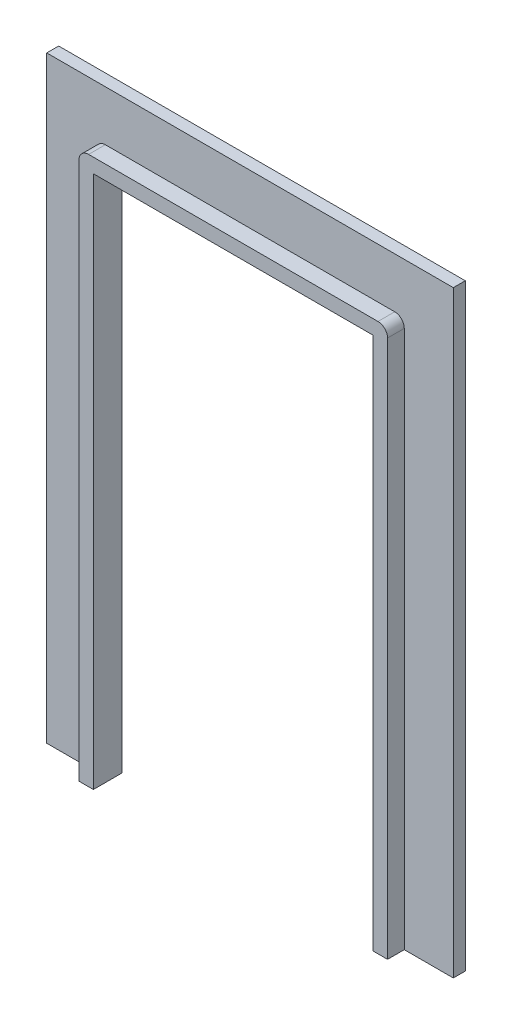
from build123d import *

# Parameters (mm, degrees)
ESQUISSE1_W             = 85
ESQUISSE1_H             = 125
EXTRUSION1_DEPTH        = 6
ESQUISSE2_OUTSIDE_W     = 117.256
ESQUISSE2_OUTSIDE_H     = 157.256
ENL_V_MAT_EXTRU_3_DEPTH = 3.5
ESQUISSE4_W             = 58.5
ESQUISSE4_H             = 111.5
ENL_V_MAT_EXTRU_4_DEPTH = 152.28119513


with BuildPart() as part:
    # Esquisse1 → Extrusion1 (new body)
    with BuildSketch(Plane.XY):
        with Locations((42.5, 62.5)):
            Rectangle(ESQUISSE1_W, ESQUISSE1_H)
    extrude(amount=EXTRUSION1_DEPTH)

    # Esquisse2 outside → Enl_v. mat.-Extru.3 (cut)
    with BuildSketch(Plane.XY.offset(6)):
        with Locations((42.5, 62.5)):
            Rectangle(ESQUISSE2_OUTSIDE_W, ESQUISSE2_OUTSIDE_H)
        with BuildLine():
            Line((10.25, 0), (74.75, 0))
            Line((74.75, 0), (74.75, 112.5))
            ThreePointArc((74.75, 112.5), (74.164213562, 113.914213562), (72.75, 114.5))
            Line((72.75, 114.5), (12.25, 114.5))
            ThreePointArc((12.25, 114.5), (10.835786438, 113.914213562), (10.25, 112.5))
            Line((10.25, 112.5), (10.25, 0))
        make_face(mode=Mode.SUBTRACT)
    extrude(amount=-ENL_V_MAT_EXTRU_3_DEPTH, mode=Mode.SUBTRACT)

    # Esquisse4 → Enl_v. mat.-Extru.4 (cut, through all)
    with BuildSketch(Plane.XY.offset(6)):
        with Locations((42.5, 55.75)):
            Rectangle(ESQUISSE4_W, ESQUISSE4_H)
    extrude(amount=-ENL_V_MAT_EXTRU_4_DEPTH, mode=Mode.SUBTRACT)


solid = part.part
